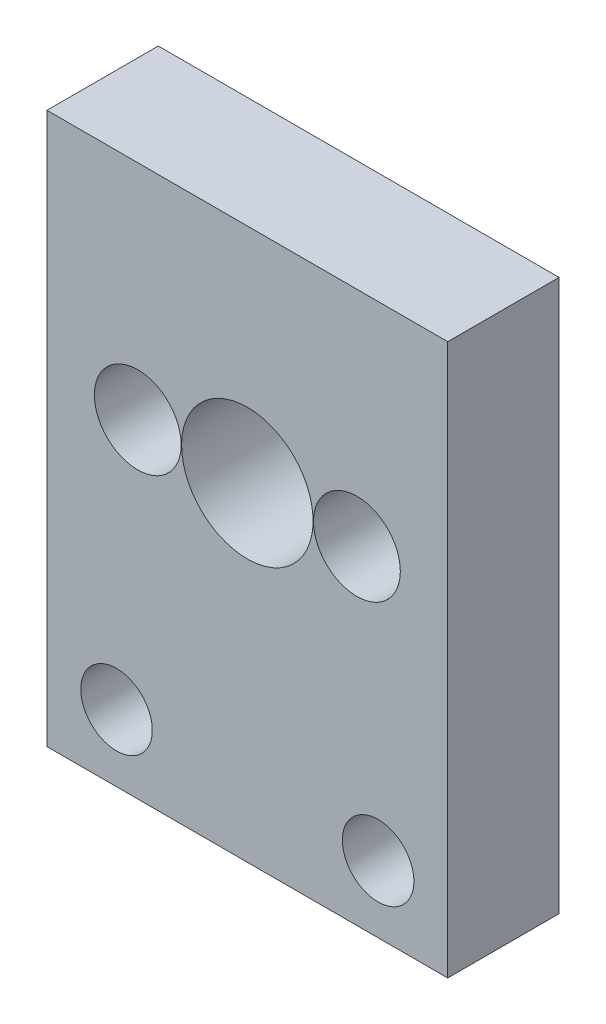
from build123d import *

# Parameters (mm, degrees)
SKETCH1_W                      = 18.288
SKETCH1_H                      = 25.146
EXTRUDE1_DEPTH                 = 5.08
SKETCH2_R                      = 3
CUT_EXTRUDE1_DEPTH             = 19.275648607
CBORE_FOR_M2_SHCS1_D           = 2.1
CBORE_FOR_M2_SHCS1_CBORE_D     = 3.9624
CBORE_FOR_M2_SHCS1_CBORE_DEPTH = 3.1
F_30_0_128500_DIAMETER_HOLE1_D = 3.2639


with BuildPart() as part:
    # Sketch1 → Extrude1 (new body)
    with BuildSketch(Plane.XY):
        with Locations((0, -2.413)):
            Rectangle(SKETCH1_W, SKETCH1_H)
    extrude(amount=EXTRUDE1_DEPTH)

    # Sketch2 → Cut-Extrude1 (cut, through all)
    with BuildSketch(Plane(origin=(0, 0, 0), x_dir=(-1, 0, 0), z_dir=(0, 0, -1))):
        Circle(SKETCH2_R)
    extrude(amount=-CUT_EXTRUDE1_DEPTH, mode=Mode.SUBTRACT)

    # CBORE for M2 SHCS1 (through all)
    with Locations(Plane.XY.offset(5.08)):
        with Locations((5, 0), (-5, 0)):
            CounterBoreHole(CBORE_FOR_M2_SHCS1_D / 2, CBORE_FOR_M2_SHCS1_CBORE_D / 2, CBORE_FOR_M2_SHCS1_CBORE_DEPTH)

    # 30 _0.128500_ Diameter Hole1 (through all)
    with Locations(Plane(origin=(0, 0, 0), x_dir=(-1, 0, 0), z_dir=(0, 0, -1))):
        with Locations((-5.969, -11.938), (5.969, -11.938)):
            Hole(F_30_0_128500_DIAMETER_HOLE1_D / 2)


solid = part.part
